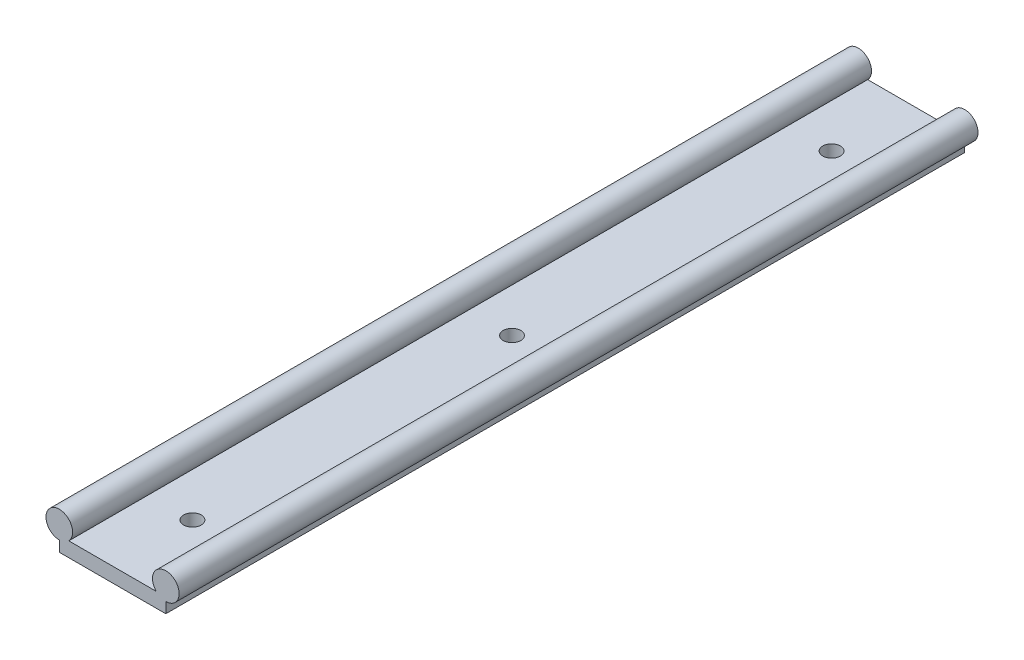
ISO-10303-21;
HEADER;
FILE_DESCRIPTION(('STEP AP214'),'2;1');
FILE_NAME('part.step','',(''),(''),'','','');
FILE_SCHEMA(('AUTOMOTIVE_DESIGN { 1 0 10303 214 1 1 1 1 }'));
ENDSEC;
DATA;
#1=APPLICATION_CONTEXT('core data for automotive mechanical design processes');
#2=APPLICATION_PROTOCOL_DEFINITION('international standard','automotive_design',2000,#1);
#3=PRODUCT_CONTEXT('',#1,'mechanical');
#4=PRODUCT('Part','Part','',(#3));
#5=PRODUCT_RELATED_PRODUCT_CATEGORY('part','',(#4));
#6=PRODUCT_DEFINITION_FORMATION('','',#4);
#7=PRODUCT_DEFINITION_CONTEXT('part definition',#1,'design');
#8=PRODUCT_DEFINITION('design','',#6,#7);
#9=PRODUCT_DEFINITION_SHAPE('','',#8);
#10=(LENGTH_UNIT() NAMED_UNIT(*) SI_UNIT(.MILLI.,.METRE.));
#11=(NAMED_UNIT(*) PLANE_ANGLE_UNIT() SI_UNIT($,.RADIAN.));
#12=(NAMED_UNIT(*) SI_UNIT($,.STERADIAN.) SOLID_ANGLE_UNIT());
#13=UNCERTAINTY_MEASURE_WITH_UNIT(LENGTH_MEASURE(1.E-05),#10,'distance_accuracy_value','');
#14=(GEOMETRIC_REPRESENTATION_CONTEXT(3) GLOBAL_UNCERTAINTY_ASSIGNED_CONTEXT((#13)) GLOBAL_UNIT_ASSIGNED_CONTEXT((#10,
#11,#12)) REPRESENTATION_CONTEXT('',''));
#15=CARTESIAN_POINT('',(0.,0.,0.));
#16=DIRECTION('',(0.,0.,1.));
#17=DIRECTION('',(1.,0.,0.));
#18=AXIS2_PLACEMENT_3D('',#15,#16,#17);
#19=CARTESIAN_POINT('',(-20.0000000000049,1.25,300.));
#20=DIRECTION('',(1.,0.,0.));
#21=DIRECTION('',(0.,0.,-1.));
#22=AXIS2_PLACEMENT_3D('',#19,#20,#21);
#23=PLANE('',#22);
#24=DIRECTION('',(0.,-1.,0.));
#25=VECTOR('',#24,1.);
#26=CARTESIAN_POINT('',(-20.0000000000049,1.25,0.));
#27=LINE('',#26,#25);
#28=CARTESIAN_POINT('',(-20.0000000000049,1.25,0.));
#29=VERTEX_POINT('',#28);
#30=CARTESIAN_POINT('',(-20.0000000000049,-2.75000000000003,0.));
#31=VERTEX_POINT('',#30);
#32=EDGE_CURVE('E114',#29,#31,#27,.T.);
#33=ORIENTED_EDGE('',*,*,#32,.T.);
#34=DIRECTION('',(0.,0.,-1.));
#35=VECTOR('',#34,1.);
#36=CARTESIAN_POINT('',(-20.0000000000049,-2.75000000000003,300.));
#37=LINE('',#36,#35);
#38=CARTESIAN_POINT('',(-20.0000000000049,-2.75000000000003,300.));
#39=VERTEX_POINT('',#38);
#40=EDGE_CURVE('E11',#39,#31,#37,.T.);
#41=ORIENTED_EDGE('',*,*,#40,.F.);
#42=DIRECTION('',(0.,-1.,0.));
#43=VECTOR('',#42,1.);
#44=CARTESIAN_POINT('',(-20.0000000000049,1.25,300.));
#45=LINE('',#44,#43);
#46=CARTESIAN_POINT('',(-20.0000000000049,1.25,300.));
#47=VERTEX_POINT('',#46);
#48=EDGE_CURVE('E125',#47,#39,#45,.T.);
#49=ORIENTED_EDGE('',*,*,#48,.F.);
#50=DIRECTION('',(0.,0.,-1.));
#51=VECTOR('',#50,1.);
#52=CARTESIAN_POINT('',(-20.0000000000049,1.25,300.));
#53=LINE('',#52,#51);
#54=EDGE_CURVE('E110',#47,#29,#53,.T.);
#55=ORIENTED_EDGE('',*,*,#54,.T.);
#56=EDGE_LOOP('',(#33,#41,#49,#55));
#57=FACE_BOUND('',#56,.T.);
#58=ADVANCED_FACE('F30',(#57),#23,.F.);
#59=CARTESIAN_POINT('',(20.0000000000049,-2.75000000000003,300.));
#60=DIRECTION('',(0.,1.,0.));
#61=DIRECTION('',(-1.,0.,0.));
#62=AXIS2_PLACEMENT_3D('',#59,#60,#61);
#63=PLANE('',#62);
#64=CARTESIAN_POINT('',(0.,-2.75000000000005,270.));
#65=DIRECTION('',(0.,1.,0.));
#66=DIRECTION('',(0.,0.,1.));
#67=AXIS2_PLACEMENT_3D('',#64,#65,#66);
#68=CIRCLE('',#67,3.3);
#69=CARTESIAN_POINT('',(0.,-2.75000000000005,273.3));
#70=VERTEX_POINT('',#69);
#71=EDGE_CURVE('E226',#70,#70,#68,.T.);
#72=ORIENTED_EDGE('',*,*,#71,.T.);
#73=EDGE_LOOP('',(#72));
#74=FACE_BOUND('',#73,.T.);
#75=CARTESIAN_POINT('',(0.,-2.75000000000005,150.));
#76=DIRECTION('',(0.,1.,0.));
#77=DIRECTION('',(0.,0.,1.));
#78=AXIS2_PLACEMENT_3D('',#75,#76,#77);
#79=CIRCLE('',#78,3.3);
#80=CARTESIAN_POINT('',(0.,-2.75000000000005,153.3));
#81=VERTEX_POINT('',#80);
#82=EDGE_CURVE('E236',#81,#81,#79,.T.);
#83=ORIENTED_EDGE('',*,*,#82,.T.);
#84=EDGE_LOOP('',(#83));
#85=FACE_BOUND('',#84,.T.);
#86=CARTESIAN_POINT('',(0.,-2.75000000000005,30.));
#87=DIRECTION('',(0.,1.,0.));
#88=DIRECTION('',(0.,0.,1.));
#89=AXIS2_PLACEMENT_3D('',#86,#87,#88);
#90=CIRCLE('',#89,3.3);
#91=CARTESIAN_POINT('',(0.,-2.75000000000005,33.3));
#92=VERTEX_POINT('',#91);
#93=EDGE_CURVE('E118',#92,#92,#90,.T.);
#94=ORIENTED_EDGE('',*,*,#93,.T.);
#95=EDGE_LOOP('',(#94));
#96=FACE_BOUND('',#95,.T.);
#97=DIRECTION('',(1.,0.,0.));
#98=VECTOR('',#97,1.);
#99=CARTESIAN_POINT('',(20.0000000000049,-2.75000000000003,0.));
#100=LINE('',#99,#98);
#101=CARTESIAN_POINT('',(20.0000000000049,-2.75000000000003,0.));
#102=VERTEX_POINT('',#101);
#103=EDGE_CURVE('E117',#31,#102,#100,.T.);
#104=ORIENTED_EDGE('',*,*,#103,.T.);
#105=DIRECTION('',(0.,0.,-1.));
#106=VECTOR('',#105,1.);
#107=CARTESIAN_POINT('',(20.0000000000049,-2.75000000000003,300.));
#108=LINE('',#107,#106);
#109=CARTESIAN_POINT('',(20.0000000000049,-2.75000000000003,300.));
#110=VERTEX_POINT('',#109);
#111=EDGE_CURVE('E38',#110,#102,#108,.T.);
#112=ORIENTED_EDGE('',*,*,#111,.F.);
#113=DIRECTION('',(1.,0.,0.));
#114=VECTOR('',#113,1.);
#115=CARTESIAN_POINT('',(20.0000000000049,-2.75000000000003,300.));
#116=LINE('',#115,#114);
#117=EDGE_CURVE('E83',#39,#110,#116,.T.);
#118=ORIENTED_EDGE('',*,*,#117,.F.);
#119=ORIENTED_EDGE('',*,*,#40,.T.);
#120=EDGE_LOOP('',(#104,#112,#118,#119));
#121=FACE_BOUND('',#120,.T.);
#122=ADVANCED_FACE('F150',(#74,#85,#96,#121),#63,.F.);
#123=CARTESIAN_POINT('',(20.0000000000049,1.25,300.));
#124=DIRECTION('',(-1.,0.,0.));
#125=DIRECTION('',(0.,0.,1.));
#126=AXIS2_PLACEMENT_3D('',#123,#124,#125);
#127=PLANE('',#126);
#128=DIRECTION('',(0.,1.,0.));
#129=VECTOR('',#128,1.);
#130=CARTESIAN_POINT('',(20.0000000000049,1.25,0.));
#131=LINE('',#130,#129);
#132=CARTESIAN_POINT('',(20.0000000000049,1.25,0.));
#133=VERTEX_POINT('',#132);
#134=EDGE_CURVE('E120',#102,#133,#131,.T.);
#135=ORIENTED_EDGE('',*,*,#134,.T.);
#136=DIRECTION('',(0.,0.,-1.));
#137=VECTOR('',#136,1.);
#138=CARTESIAN_POINT('',(20.0000000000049,1.25,300.));
#139=LINE('',#138,#137);
#140=CARTESIAN_POINT('',(20.0000000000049,1.25,300.));
#141=VERTEX_POINT('',#140);
#142=EDGE_CURVE('E105',#141,#133,#139,.T.);
#143=ORIENTED_EDGE('',*,*,#142,.F.);
#144=DIRECTION('',(0.,1.,0.));
#145=VECTOR('',#144,1.);
#146=CARTESIAN_POINT('',(20.0000000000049,1.25,300.));
#147=LINE('',#146,#145);
#148=EDGE_CURVE('E96',#110,#141,#147,.T.);
#149=ORIENTED_EDGE('',*,*,#148,.F.);
#150=ORIENTED_EDGE('',*,*,#111,.T.);
#151=EDGE_LOOP('',(#135,#143,#149,#150));
#152=FACE_BOUND('',#151,.T.);
#153=ADVANCED_FACE('F131',(#152),#127,.F.);
#154=CARTESIAN_POINT('',(20.,6.25000000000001,300.));
#155=DIRECTION('',(0.,0.,-1.));
#156=DIRECTION('',(-1.,0.,0.));
#157=AXIS2_PLACEMENT_3D('',#154,#155,#156);
#158=CYLINDRICAL_SURFACE('',#157,5.);
#159=CARTESIAN_POINT('',(20.,6.25000000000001,0.));
#160=DIRECTION('',(0.,0.,1.));
#161=DIRECTION('',(1.,0.,0.));
#162=AXIS2_PLACEMENT_3D('',#159,#160,#161);
#163=CIRCLE('',#162,5.);
#164=CARTESIAN_POINT('',(16.4292857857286,2.74999999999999,0.));
#165=VERTEX_POINT('',#164);
#166=EDGE_CURVE('E104',#133,#165,#163,.T.);
#167=ORIENTED_EDGE('',*,*,#166,.T.);
#168=DIRECTION('',(0.,0.,-1.));
#169=VECTOR('',#168,1.);
#170=CARTESIAN_POINT('',(16.4292857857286,2.74999999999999,300.));
#171=LINE('',#170,#169);
#172=CARTESIAN_POINT('',(16.4292857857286,2.74999999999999,300.));
#173=VERTEX_POINT('',#172);
#174=EDGE_CURVE('E101',#173,#165,#171,.T.);
#175=ORIENTED_EDGE('',*,*,#174,.F.);
#176=CARTESIAN_POINT('',(20.,6.25000000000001,300.));
#177=DIRECTION('',(0.,0.,1.));
#178=DIRECTION('',(1.,0.,0.));
#179=AXIS2_PLACEMENT_3D('',#176,#177,#178);
#180=CIRCLE('',#179,5.);
#181=EDGE_CURVE('E90',#141,#173,#180,.T.);
#182=ORIENTED_EDGE('',*,*,#181,.F.);
#183=ORIENTED_EDGE('',*,*,#142,.T.);
#184=EDGE_LOOP('',(#167,#175,#182,#183));
#185=FACE_BOUND('',#184,.T.);
#186=ADVANCED_FACE('F102',(#185),#158,.T.);
#187=CARTESIAN_POINT('',(16.4292857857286,2.74999999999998,300.));
#188=DIRECTION('',(0.,-1.,0.));
#189=DIRECTION('',(1.,0.,0.));
#190=AXIS2_PLACEMENT_3D('',#187,#188,#189);
#191=PLANE('',#190);
#192=CARTESIAN_POINT('',(0.,2.74999999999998,270.));
#193=DIRECTION('',(0.,1.,0.));
#194=DIRECTION('',(0.,0.,1.));
#195=AXIS2_PLACEMENT_3D('',#192,#193,#194);
#196=CIRCLE('',#195,3.29999999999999);
#197=CARTESIAN_POINT('',(0.,2.74999999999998,273.3));
#198=VERTEX_POINT('',#197);
#199=EDGE_CURVE('E229',#198,#198,#196,.T.);
#200=ORIENTED_EDGE('',*,*,#199,.F.);
#201=EDGE_LOOP('',(#200));
#202=FACE_BOUND('',#201,.T.);
#203=CARTESIAN_POINT('',(0.,2.74999999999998,150.));
#204=DIRECTION('',(0.,1.,0.));
#205=DIRECTION('',(0.,0.,1.));
#206=AXIS2_PLACEMENT_3D('',#203,#204,#205);
#207=CIRCLE('',#206,3.29999999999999);
#208=CARTESIAN_POINT('',(0.,2.74999999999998,153.3));
#209=VERTEX_POINT('',#208);
#210=EDGE_CURVE('E231',#209,#209,#207,.T.);
#211=ORIENTED_EDGE('',*,*,#210,.F.);
#212=EDGE_LOOP('',(#211));
#213=FACE_BOUND('',#212,.T.);
#214=CARTESIAN_POINT('',(0.,2.74999999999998,30.));
#215=DIRECTION('',(0.,1.,0.));
#216=DIRECTION('',(0.,0.,1.));
#217=AXIS2_PLACEMENT_3D('',#214,#215,#216);
#218=CIRCLE('',#217,3.29999999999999);
#219=CARTESIAN_POINT('',(0.,2.74999999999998,33.3));
#220=VERTEX_POINT('',#219);
#221=EDGE_CURVE('E239',#220,#220,#218,.T.);
#222=ORIENTED_EDGE('',*,*,#221,.F.);
#223=EDGE_LOOP('',(#222));
#224=FACE_BOUND('',#223,.T.);
#225=DIRECTION('',(-1.,0.,0.));
#226=VECTOR('',#225,1.);
#227=CARTESIAN_POINT('',(16.4292857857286,2.74999999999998,0.));
#228=LINE('',#227,#226);
#229=CARTESIAN_POINT('',(-16.4292857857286,2.74999999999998,0.));
#230=VERTEX_POINT('',#229);
#231=EDGE_CURVE('E69',#165,#230,#228,.T.);
#232=ORIENTED_EDGE('',*,*,#231,.T.);
#233=DIRECTION('',(0.,0.,-1.));
#234=VECTOR('',#233,1.);
#235=CARTESIAN_POINT('',(-16.4292857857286,2.74999999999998,300.));
#236=LINE('',#235,#234);
#237=CARTESIAN_POINT('',(-16.4292857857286,2.74999999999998,300.));
#238=VERTEX_POINT('',#237);
#239=EDGE_CURVE('E106',#238,#230,#236,.T.);
#240=ORIENTED_EDGE('',*,*,#239,.F.);
#241=DIRECTION('',(-1.,0.,0.));
#242=VECTOR('',#241,1.);
#243=CARTESIAN_POINT('',(16.4292857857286,2.74999999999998,300.));
#244=LINE('',#243,#242);
#245=EDGE_CURVE('E94',#173,#238,#244,.T.);
#246=ORIENTED_EDGE('',*,*,#245,.F.);
#247=ORIENTED_EDGE('',*,*,#174,.T.);
#248=EDGE_LOOP('',(#232,#240,#246,#247));
#249=FACE_BOUND('',#248,.T.);
#250=ADVANCED_FACE('F108',(#202,#213,#224,#249),#191,.F.);
#251=CARTESIAN_POINT('',(-20.,6.25,300.));
#252=DIRECTION('',(0.,0.,-1.));
#253=DIRECTION('',(-1.,0.,0.));
#254=AXIS2_PLACEMENT_3D('',#251,#252,#253);
#255=CYLINDRICAL_SURFACE('',#254,5.);
#256=CARTESIAN_POINT('',(-20.,6.25,0.));
#257=DIRECTION('',(0.,0.,1.));
#258=DIRECTION('',(-1.,0.,0.));
#259=AXIS2_PLACEMENT_3D('',#256,#257,#258);
#260=CIRCLE('',#259,5.);
#261=EDGE_CURVE('E75',#230,#29,#260,.T.);
#262=ORIENTED_EDGE('',*,*,#261,.T.);
#263=ORIENTED_EDGE('',*,*,#54,.F.);
#264=CARTESIAN_POINT('',(-20.,6.25,300.));
#265=DIRECTION('',(0.,0.,1.));
#266=DIRECTION('',(-1.,0.,0.));
#267=AXIS2_PLACEMENT_3D('',#264,#265,#266);
#268=CIRCLE('',#267,5.);
#269=EDGE_CURVE('E46',#238,#47,#268,.T.);
#270=ORIENTED_EDGE('',*,*,#269,.F.);
#271=ORIENTED_EDGE('',*,*,#239,.T.);
#272=EDGE_LOOP('',(#262,#263,#270,#271));
#273=FACE_BOUND('',#272,.T.);
#274=ADVANCED_FACE('F138',(#273),#255,.T.);
#275=CARTESIAN_POINT('',(20.,6.25000000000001,300.));
#276=DIRECTION('',(0.,0.,1.));
#277=DIRECTION('',(1.,0.,0.));
#278=AXIS2_PLACEMENT_3D('',#275,#276,#277);
#279=PLANE('',#278);
#280=ORIENTED_EDGE('',*,*,#48,.T.);
#281=ORIENTED_EDGE('',*,*,#117,.T.);
#282=ORIENTED_EDGE('',*,*,#148,.T.);
#283=ORIENTED_EDGE('',*,*,#181,.T.);
#284=ORIENTED_EDGE('',*,*,#245,.T.);
#285=ORIENTED_EDGE('',*,*,#269,.T.);
#286=EDGE_LOOP('',(#280,#281,#282,#283,#284,#285));
#287=FACE_BOUND('',#286,.T.);
#288=ADVANCED_FACE('F92',(#287),#279,.T.);
#289=CARTESIAN_POINT('',(20.,6.25000000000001,0.));
#290=DIRECTION('',(0.,0.,1.));
#291=DIRECTION('',(1.,0.,0.));
#292=AXIS2_PLACEMENT_3D('',#289,#290,#291);
#293=PLANE('',#292);
#294=ORIENTED_EDGE('',*,*,#32,.F.);
#295=ORIENTED_EDGE('',*,*,#261,.F.);
#296=ORIENTED_EDGE('',*,*,#231,.F.);
#297=ORIENTED_EDGE('',*,*,#166,.F.);
#298=ORIENTED_EDGE('',*,*,#134,.F.);
#299=ORIENTED_EDGE('',*,*,#103,.F.);
#300=EDGE_LOOP('',(#294,#295,#296,#297,#298,#299));
#301=FACE_BOUND('',#300,.T.);
#302=ADVANCED_FACE('F134',(#301),#293,.F.);
#303=CARTESIAN_POINT('',(0.,2.74999999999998,30.));
#304=DIRECTION('',(0.,1.,0.));
#305=DIRECTION('',(0.,0.,1.));
#306=AXIS2_PLACEMENT_3D('',#303,#304,#305);
#307=CYLINDRICAL_SURFACE('',#306,3.29999999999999);
#308=ORIENTED_EDGE('',*,*,#93,.F.);
#309=EDGE_LOOP('',(#308));
#310=FACE_BOUND('',#309,.T.);
#311=ORIENTED_EDGE('',*,*,#221,.T.);
#312=EDGE_LOOP('',(#311));
#313=FACE_BOUND('',#312,.T.);
#314=ADVANCED_FACE('F180',(#310,#313),#307,.F.);
#315=CARTESIAN_POINT('',(0.,2.74999999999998,150.));
#316=DIRECTION('',(0.,1.,0.));
#317=DIRECTION('',(0.,0.,1.));
#318=AXIS2_PLACEMENT_3D('',#315,#316,#317);
#319=CYLINDRICAL_SURFACE('',#318,3.29999999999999);
#320=ORIENTED_EDGE('',*,*,#82,.F.);
#321=EDGE_LOOP('',(#320));
#322=FACE_BOUND('',#321,.T.);
#323=ORIENTED_EDGE('',*,*,#210,.T.);
#324=EDGE_LOOP('',(#323));
#325=FACE_BOUND('',#324,.T.);
#326=ADVANCED_FACE('F185',(#322,#325),#319,.F.);
#327=CARTESIAN_POINT('',(0.,2.74999999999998,270.));
#328=DIRECTION('',(0.,1.,0.));
#329=DIRECTION('',(0.,0.,1.));
#330=AXIS2_PLACEMENT_3D('',#327,#328,#329);
#331=CYLINDRICAL_SURFACE('',#330,3.29999999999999);
#332=ORIENTED_EDGE('',*,*,#71,.F.);
#333=EDGE_LOOP('',(#332));
#334=FACE_BOUND('',#333,.T.);
#335=ORIENTED_EDGE('',*,*,#199,.T.);
#336=EDGE_LOOP('',(#335));
#337=FACE_BOUND('',#336,.T.);
#338=ADVANCED_FACE('F197',(#334,#337),#331,.F.);
#339=CLOSED_SHELL('',(#58,#122,#153,#186,#250,#274,#288,#302,#314,#326,#338));
#340=MANIFOLD_SOLID_BREP('B2',#339);
#341=ADVANCED_BREP_SHAPE_REPRESENTATION('',(#18,#340),#14);
#342=SHAPE_DEFINITION_REPRESENTATION(#9,#341);
ENDSEC;
END-ISO-10303-21;
